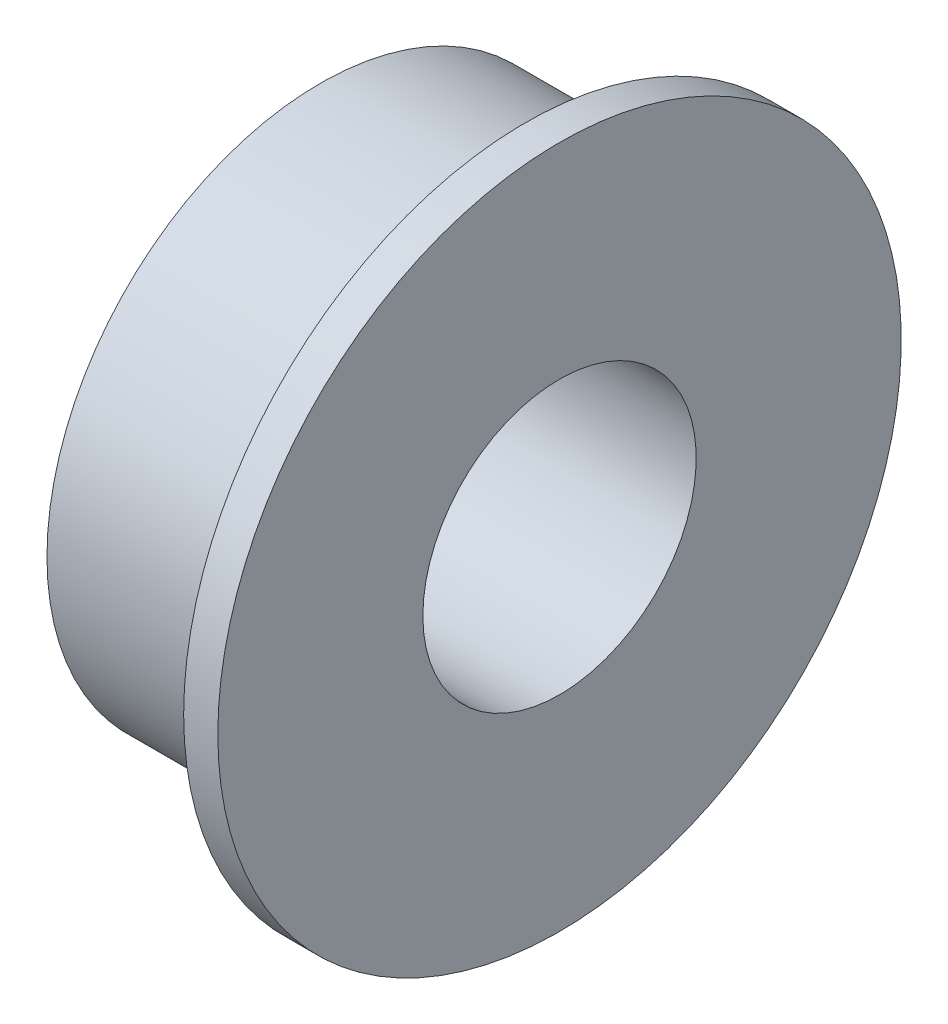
ISO-10303-21;
HEADER;
FILE_DESCRIPTION(('STEP AP214'),'2;1');
FILE_NAME('part.step','',(''),(''),'','','');
FILE_SCHEMA(('AUTOMOTIVE_DESIGN { 1 0 10303 214 1 1 1 1 }'));
ENDSEC;
DATA;
#1=APPLICATION_CONTEXT('core data for automotive mechanical design processes');
#2=APPLICATION_PROTOCOL_DEFINITION('international standard','automotive_design',2000,#1);
#3=PRODUCT_CONTEXT('',#1,'mechanical');
#4=PRODUCT('Part','Part','',(#3));
#5=PRODUCT_RELATED_PRODUCT_CATEGORY('part','',(#4));
#6=PRODUCT_DEFINITION_FORMATION('','',#4);
#7=PRODUCT_DEFINITION_CONTEXT('part definition',#1,'design');
#8=PRODUCT_DEFINITION('design','',#6,#7);
#9=PRODUCT_DEFINITION_SHAPE('','',#8);
#10=(LENGTH_UNIT() NAMED_UNIT(*) SI_UNIT(.MILLI.,.METRE.));
#11=(NAMED_UNIT(*) PLANE_ANGLE_UNIT() SI_UNIT($,.RADIAN.));
#12=(NAMED_UNIT(*) SI_UNIT($,.STERADIAN.) SOLID_ANGLE_UNIT());
#13=UNCERTAINTY_MEASURE_WITH_UNIT(LENGTH_MEASURE(1.E-05),#10,'distance_accuracy_value','');
#14=(GEOMETRIC_REPRESENTATION_CONTEXT(3) GLOBAL_UNCERTAINTY_ASSIGNED_CONTEXT((#13)) GLOBAL_UNIT_ASSIGNED_CONTEXT((#10,
#11,#12)) REPRESENTATION_CONTEXT('',''));
#15=CARTESIAN_POINT('',(0.,0.,0.));
#16=DIRECTION('',(0.,0.,1.));
#17=DIRECTION('',(1.,0.,0.));
#18=AXIS2_PLACEMENT_3D('',#15,#16,#17);
#19=CARTESIAN_POINT('',(23.5,0.,2.));
#20=DIRECTION('',(1.,0.,0.));
#21=DIRECTION('',(0.,0.,-1.));
#22=AXIS2_PLACEMENT_3D('',#19,#20,#21);
#23=PLANE('',#22);
#24=CARTESIAN_POINT('',(23.5,0.,0.));
#25=DIRECTION('',(-1.,0.,0.));
#26=DIRECTION('',(0.,0.,1.));
#27=AXIS2_PLACEMENT_3D('',#24,#25,#26);
#28=CIRCLE('',#27,2.);
#29=CARTESIAN_POINT('',(23.5,0.,2.));
#30=VERTEX_POINT('',#29);
#31=EDGE_CURVE('E388',#30,#30,#28,.T.);
#32=ORIENTED_EDGE('',*,*,#31,.T.);
#33=EDGE_LOOP('',(#32));
#34=FACE_BOUND('',#33,.T.);
#35=CARTESIAN_POINT('',(23.5,0.,0.));
#36=DIRECTION('',(-1.,0.,0.));
#37=DIRECTION('',(0.,0.,1.));
#38=AXIS2_PLACEMENT_3D('',#35,#36,#37);
#39=CIRCLE('',#38,5.);
#40=CARTESIAN_POINT('',(23.5,0.,5.));
#41=VERTEX_POINT('',#40);
#42=EDGE_CURVE('E10',#41,#41,#39,.T.);
#43=ORIENTED_EDGE('',*,*,#42,.F.);
#44=EDGE_LOOP('',(#43));
#45=FACE_BOUND('',#44,.T.);
#46=ADVANCED_FACE('F366',(#34,#45),#23,.T.);
#47=CARTESIAN_POINT('',(0.,0.,0.));
#48=DIRECTION('',(-1.,0.,0.));
#49=DIRECTION('',(0.,0.,1.));
#50=AXIS2_PLACEMENT_3D('',#47,#48,#49);
#51=CYLINDRICAL_SURFACE('',#50,5.);
#52=ORIENTED_EDGE('',*,*,#42,.T.);
#53=EDGE_LOOP('',(#52));
#54=FACE_BOUND('',#53,.T.);
#55=CARTESIAN_POINT('',(23.,0.,0.));
#56=DIRECTION('',(-1.,0.,0.));
#57=DIRECTION('',(0.,0.,1.));
#58=AXIS2_PLACEMENT_3D('',#55,#56,#57);
#59=CIRCLE('',#58,5.);
#60=CARTESIAN_POINT('',(23.,0.,5.));
#61=VERTEX_POINT('',#60);
#62=EDGE_CURVE('E372',#61,#61,#59,.T.);
#63=ORIENTED_EDGE('',*,*,#62,.F.);
#64=EDGE_LOOP('',(#63));
#65=FACE_BOUND('',#64,.T.);
#66=ADVANCED_FACE('F406',(#54,#65),#51,.T.);
#67=CARTESIAN_POINT('',(23.,0.,5.));
#68=DIRECTION('',(-1.,0.,0.));
#69=DIRECTION('',(0.,0.,1.));
#70=AXIS2_PLACEMENT_3D('',#67,#68,#69);
#71=PLANE('',#70);
#72=ORIENTED_EDGE('',*,*,#62,.T.);
#73=EDGE_LOOP('',(#72));
#74=FACE_BOUND('',#73,.T.);
#75=CARTESIAN_POINT('',(23.,0.,0.));
#76=DIRECTION('',(-1.,0.,0.));
#77=DIRECTION('',(0.,0.,1.));
#78=AXIS2_PLACEMENT_3D('',#75,#76,#77);
#79=CIRCLE('',#78,4.);
#80=CARTESIAN_POINT('',(23.,0.,4.));
#81=VERTEX_POINT('',#80);
#82=EDGE_CURVE('E376',#81,#81,#79,.T.);
#83=ORIENTED_EDGE('',*,*,#82,.F.);
#84=EDGE_LOOP('',(#83));
#85=FACE_BOUND('',#84,.T.);
#86=ADVANCED_FACE('F410',(#74,#85),#71,.T.);
#87=CARTESIAN_POINT('',(0.,0.,0.));
#88=DIRECTION('',(-1.,0.,0.));
#89=DIRECTION('',(0.,0.,1.));
#90=AXIS2_PLACEMENT_3D('',#87,#88,#89);
#91=CYLINDRICAL_SURFACE('',#90,4.);
#92=ORIENTED_EDGE('',*,*,#82,.T.);
#93=EDGE_LOOP('',(#92));
#94=FACE_BOUND('',#93,.T.);
#95=CARTESIAN_POINT('',(20.,0.,0.));
#96=DIRECTION('',(-1.,0.,0.));
#97=DIRECTION('',(0.,0.,1.));
#98=AXIS2_PLACEMENT_3D('',#95,#96,#97);
#99=CIRCLE('',#98,4.);
#100=CARTESIAN_POINT('',(20.,0.,4.));
#101=VERTEX_POINT('',#100);
#102=EDGE_CURVE('E380',#101,#101,#99,.T.);
#103=ORIENTED_EDGE('',*,*,#102,.F.);
#104=EDGE_LOOP('',(#103));
#105=FACE_BOUND('',#104,.T.);
#106=ADVANCED_FACE('F402',(#94,#105),#91,.T.);
#107=CARTESIAN_POINT('',(20.,0.,4.));
#108=DIRECTION('',(-1.,0.,0.));
#109=DIRECTION('',(0.,0.,1.));
#110=AXIS2_PLACEMENT_3D('',#107,#108,#109);
#111=PLANE('',#110);
#112=ORIENTED_EDGE('',*,*,#102,.T.);
#113=EDGE_LOOP('',(#112));
#114=FACE_BOUND('',#113,.T.);
#115=CARTESIAN_POINT('',(20.,0.,0.));
#116=DIRECTION('',(-1.,0.,0.));
#117=DIRECTION('',(0.,0.,1.));
#118=AXIS2_PLACEMENT_3D('',#115,#116,#117);
#119=CIRCLE('',#118,2.);
#120=CARTESIAN_POINT('',(20.,0.,2.));
#121=VERTEX_POINT('',#120);
#122=EDGE_CURVE('E385',#121,#121,#119,.T.);
#123=ORIENTED_EDGE('',*,*,#122,.F.);
#124=EDGE_LOOP('',(#123));
#125=FACE_BOUND('',#124,.T.);
#126=ADVANCED_FACE('F396',(#114,#125),#111,.T.);
#127=CARTESIAN_POINT('',(0.,0.,0.));
#128=DIRECTION('',(-1.,0.,0.));
#129=DIRECTION('',(0.,0.,1.));
#130=AXIS2_PLACEMENT_3D('',#127,#128,#129);
#131=CYLINDRICAL_SURFACE('',#130,2.);
#132=ORIENTED_EDGE('',*,*,#122,.T.);
#133=EDGE_LOOP('',(#132));
#134=FACE_BOUND('',#133,.T.);
#135=ORIENTED_EDGE('',*,*,#31,.F.);
#136=EDGE_LOOP('',(#135));
#137=FACE_BOUND('',#136,.T.);
#138=ADVANCED_FACE('F394',(#134,#137),#131,.F.);
#139=CLOSED_SHELL('',(#46,#66,#86,#106,#126,#138));
#140=MANIFOLD_SOLID_BREP('B2',#139);
#141=ADVANCED_BREP_SHAPE_REPRESENTATION('',(#18,#140),#14);
#142=SHAPE_DEFINITION_REPRESENTATION(#9,#141);
ENDSEC;
END-ISO-10303-21;
